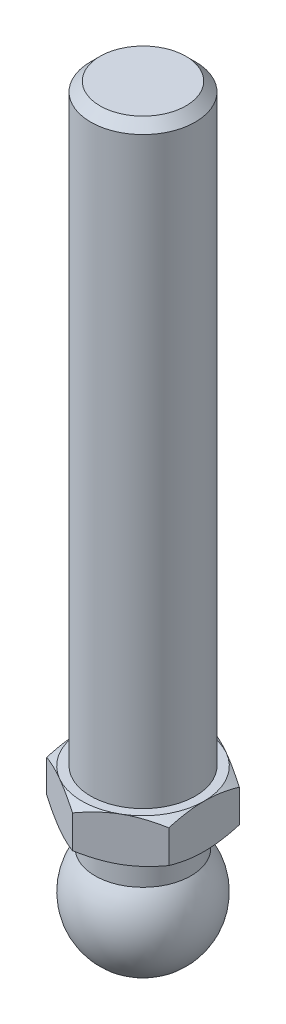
ISO-10303-21;
HEADER;
FILE_DESCRIPTION(('STEP AP214'),'2;1');
FILE_NAME('part.step','',(''),(''),'','','');
FILE_SCHEMA(('AUTOMOTIVE_DESIGN { 1 0 10303 214 1 1 1 1 }'));
ENDSEC;
DATA;
#1=APPLICATION_CONTEXT('core data for automotive mechanical design processes');
#2=APPLICATION_PROTOCOL_DEFINITION('international standard','automotive_design',2000,#1);
#3=PRODUCT_CONTEXT('',#1,'mechanical');
#4=PRODUCT('Part','Part','',(#3));
#5=PRODUCT_RELATED_PRODUCT_CATEGORY('part','',(#4));
#6=PRODUCT_DEFINITION_FORMATION('','',#4);
#7=PRODUCT_DEFINITION_CONTEXT('part definition',#1,'design');
#8=PRODUCT_DEFINITION('design','',#6,#7);
#9=PRODUCT_DEFINITION_SHAPE('','',#8);
#10=(LENGTH_UNIT() NAMED_UNIT(*) SI_UNIT(.MILLI.,.METRE.));
#11=(NAMED_UNIT(*) PLANE_ANGLE_UNIT() SI_UNIT($,.RADIAN.));
#12=(NAMED_UNIT(*) SI_UNIT($,.STERADIAN.) SOLID_ANGLE_UNIT());
#13=UNCERTAINTY_MEASURE_WITH_UNIT(LENGTH_MEASURE(1.E-05),#10,'distance_accuracy_value','');
#14=(GEOMETRIC_REPRESENTATION_CONTEXT(3) GLOBAL_UNCERTAINTY_ASSIGNED_CONTEXT((#13)) GLOBAL_UNIT_ASSIGNED_CONTEXT((#10,
#11,#12)) REPRESENTATION_CONTEXT('',''));
#15=CARTESIAN_POINT('',(0.,0.,0.));
#16=DIRECTION('',(0.,0.,1.));
#17=DIRECTION('',(1.,0.,0.));
#18=AXIS2_PLACEMENT_3D('',#15,#16,#17);
#19=CARTESIAN_POINT('',(0.,19.5,0.));
#20=DIRECTION('',(0.,-1.,0.));
#21=DIRECTION('',(0.,0.,-1.));
#22=AXIS2_PLACEMENT_3D('',#19,#20,#21);
#23=CONICAL_SURFACE('',#22,7.,1.0471975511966);
#24=CARTESIAN_POINT('',(-7.,15.2688336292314,12.5023453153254));
#25=CARTESIAN_POINT('',(-7.,15.4184696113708,12.2052647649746));
#26=CARTESIAN_POINT('',(-7.,15.5671267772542,11.9076861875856));
#27=CARTESIAN_POINT('',(-7.,15.8620076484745,11.3113035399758));
#28=CARTESIAN_POINT('',(-7.,16.0082312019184,11.0124993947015));
#29=CARTESIAN_POINT('',(-7.,16.2980281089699,10.4128982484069));
#30=CARTESIAN_POINT('',(-7.,16.441595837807,10.1120985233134));
#31=CARTESIAN_POINT('',(-7.,16.7251296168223,9.50881013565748));
#32=CARTESIAN_POINT('',(-7.,16.8650957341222,9.20632150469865));
#33=CARTESIAN_POINT('',(-7.,17.1470427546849,8.58510325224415));
#34=CARTESIAN_POINT('',(-7.,17.2888108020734,8.26627671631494));
#35=CARTESIAN_POINT('',(-7.,17.5662200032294,7.62594250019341));
#36=CARTESIAN_POINT('',(-7.,17.7018608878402,7.30443470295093));
#37=CARTESIAN_POINT('',(-7.,17.9652496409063,6.65840905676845));
#38=CARTESIAN_POINT('',(-7.,18.0930022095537,6.33389313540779));
#39=CARTESIAN_POINT('',(-7.,18.3384540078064,5.68109770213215));
#40=CARTESIAN_POINT('',(-7.,18.4561543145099,5.35281859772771));
#41=CARTESIAN_POINT('',(-7.,18.7028165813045,4.61998548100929));
#42=CARTESIAN_POINT('',(-7.,18.8286623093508,4.21436746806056));
#43=CARTESIAN_POINT('',(-7.,19.0543524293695,3.39574912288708));
#44=CARTESIAN_POINT('',(-7.,19.1541980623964,2.98274914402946));
#45=CARTESIAN_POINT('',(-7.,19.2776062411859,2.36178861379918));
#46=CARTESIAN_POINT('',(-7.,19.3141378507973,2.15638627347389));
#47=CARTESIAN_POINT('',(-7.,19.3780104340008,1.74416917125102));
#48=CARTESIAN_POINT('',(-7.,19.4053527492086,1.53735462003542));
#49=CARTESIAN_POINT('',(-7.,19.4500375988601,1.1227076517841));
#50=CARTESIAN_POINT('',(-7.,19.467383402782,0.914875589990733));
#51=CARTESIAN_POINT('',(-7.,19.4915250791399,0.498594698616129));
#52=CARTESIAN_POINT('',(-7.,19.4983210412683,0.290145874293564));
#53=CARTESIAN_POINT('',(-7.,19.5011397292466,-0.128421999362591));
#54=CARTESIAN_POINT('',(-7.,19.4970795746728,-0.338541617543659));
#55=CARTESIAN_POINT('',(-7.,19.4781521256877,-0.758289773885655));
#56=CARTESIAN_POINT('',(-7.,19.463284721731,-0.967918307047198));
#57=CARTESIAN_POINT('',(-7.,19.4232345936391,-1.38625975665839));
#58=CARTESIAN_POINT('',(-7.,19.3980479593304,-1.59497229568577));
#59=CARTESIAN_POINT('',(-7.,19.3381380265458,-2.01100790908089));
#60=CARTESIAN_POINT('',(-7.,19.3034145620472,-2.21833095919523));
#61=CARTESIAN_POINT('',(-7.,19.1849408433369,-2.84522045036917));
#62=CARTESIAN_POINT('',(-7.,19.0876569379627,-3.26225118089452));
#63=CARTESIAN_POINT('',(-7.,18.8658468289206,-4.08879182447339));
#64=CARTESIAN_POINT('',(-7.,18.7413180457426,-4.4983010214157));
#65=CARTESIAN_POINT('',(-7.,18.4953846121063,-5.2406101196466));
#66=CARTESIAN_POINT('',(-7.,18.3771372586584,-5.5744719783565));
#67=CARTESIAN_POINT('',(-7.,18.1300009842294,-6.23825206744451));
#68=CARTESIAN_POINT('',(-7.,18.0011107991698,-6.56816982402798));
#69=CARTESIAN_POINT('',(-7.,17.7350197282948,-7.22486424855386));
#70=CARTESIAN_POINT('',(-7.,17.5978135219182,-7.55163874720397));
#71=CARTESIAN_POINT('',(-7.,17.3169731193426,-8.20238370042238));
#72=CARTESIAN_POINT('',(-7.,17.1733392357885,-8.5263542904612));
#73=CARTESIAN_POINT('',(-7.,16.8876445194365,-9.15729037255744));
#74=CARTESIAN_POINT('',(-7.,16.7458097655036,-9.46435857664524));
#75=CARTESIAN_POINT('',(-7.,16.4583976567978,-10.0767426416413));
#76=CARTESIAN_POINT('',(-7.,16.3128202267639,-10.3820584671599));
#77=CARTESIAN_POINT('',(-7.,16.018926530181,-10.990585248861));
#78=CARTESIAN_POINT('',(-7.,15.8706165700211,-11.2937992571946));
#79=CARTESIAN_POINT('',(-7.,15.5714843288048,-11.8989613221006));
#80=CARTESIAN_POINT('',(-7.,15.4206622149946,-12.2009094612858));
#81=CARTESIAN_POINT('',(-7.,15.2688336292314,-12.5023453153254));
#82=B_SPLINE_CURVE_WITH_KNOTS('',3,(#24,#25,#26,#27,#28,#29,#30,#31,#32,#33,#34,#35,#36,#37,#38,
#39,#40,#41,#42,#43,#44,#45,#46,#47,#48,#49,#50,#51,#52,#53,#54,#55,#56,#57,#58,#59,#60,#61,#62,
#63,#64,#65,#66,#67,#68,#69,#70,#71,#72,#73,#74,#75,#76,#77,#78,#79,#80,#81),.UNSPECIFIED.,.F.,
.F.,(4,2,2,2,2,2,2,2,2,2,2,2,2,2,2,2,2,2,2,2,2,2,2,2,2,2,2,2,4),(0.,0.997917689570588,
1.99589743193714,2.99579247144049,3.99566886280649,5.04239250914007,6.08916209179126,
7.13530182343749,8.18132932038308,9.45480706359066,10.7282240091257,11.3539282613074,
11.9795411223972,12.6049492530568,13.2303520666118,13.8605430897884,14.490740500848,
15.1211769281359,15.7516243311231,17.0349275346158,18.3183522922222,19.380686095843,
20.4431462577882,21.506293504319,22.5693890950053,23.5840866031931,24.5988045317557,
25.6114179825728,26.6239642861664),.UNSPECIFIED.);
#83=CARTESIAN_POINT('',(-7.,18.8747852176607,4.04145188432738));
#84=VERTEX_POINT('',#83);
#85=CARTESIAN_POINT('',(-7.,19.5,0.));
#86=VERTEX_POINT('',#85);
#87=EDGE_CURVE('E358',#84,#86,#82,.T.);
#88=ORIENTED_EDGE('',*,*,#87,.F.);
#89=CARTESIAN_POINT('',(0.0002,18.8747185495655,8.0830192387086));
#90=CARTESIAN_POINT('',(-0.153667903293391,18.9260001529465,7.99418356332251));
#91=CARTESIAN_POINT('',(-0.30810950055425,18.9749544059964,7.90501666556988));
#92=CARTESIAN_POINT('',(-0.618246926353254,19.0675672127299,7.72595873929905));
#93=CARTESIAN_POINT('',(-0.773943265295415,19.1112234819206,7.63606741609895));
#94=CARTESIAN_POINT('',(-1.24352516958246,19.2333884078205,7.36495417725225));
#95=CARTESIAN_POINT('',(-1.5592643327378,19.302874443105,7.18266208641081));
#96=CARTESIAN_POINT('',(-2.03176224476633,19.3843550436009,6.9098652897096));
#97=CARTESIAN_POINT('',(-2.18710922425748,19.4075665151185,6.82017566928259));
#98=CARTESIAN_POINT('',(-2.49850511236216,19.4464887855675,6.64039116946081));
#99=CARTESIAN_POINT('',(-2.65455395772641,19.4622002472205,6.55029632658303));
#100=CARTESIAN_POINT('',(-2.96692267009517,19.4857220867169,6.36995016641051));
#101=CARTESIAN_POINT('',(-3.12324202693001,19.4935414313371,6.27969914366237));
#102=CARTESIAN_POINT('',(-3.43601650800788,19.5011197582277,6.09911871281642));
#103=CARTESIAN_POINT('',(-3.59247162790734,19.500878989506,6.00878930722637));
#104=CARTESIAN_POINT('',(-4.02110687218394,19.4891402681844,5.76131663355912));
#105=CARTESIAN_POINT('',(-4.2931466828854,19.4694342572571,5.60425437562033));
#106=CARTESIAN_POINT('',(-4.83541944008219,19.4069465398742,5.29117305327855));
#107=CARTESIAN_POINT('',(-5.10565047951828,19.364143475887,5.13515508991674));
#108=CARTESIAN_POINT('',(-5.64901454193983,19.2571483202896,4.82144370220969));
#109=CARTESIAN_POINT('',(-5.92207900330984,19.1925029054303,4.66378986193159));
#110=CARTESIAN_POINT('',(-6.46413578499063,19.045783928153,4.35083323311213));
#111=CARTESIAN_POINT('',(-6.73313504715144,18.9637448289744,4.19552643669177));
#112=CARTESIAN_POINT('',(-7.0002,18.8747185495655,4.04133641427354));
#113=B_SPLINE_CURVE_WITH_KNOTS('',3,(#89,#90,#91,#92,#93,#94,#95,#96,#97,#98,#99,#100,#101,#102,
#103,#104,#105,#106,#107,#108,#109,#110,#111,#112),.UNSPECIFIED.,.F.,.F.,(4,2,2,2,2,2,2,2,2,2,2,
4),(0.,0.554727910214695,1.10969417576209,2.2219327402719,2.76443041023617,3.30688013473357,
3.8487128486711,4.39052882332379,5.33376515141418,6.27787517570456,7.2429241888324,
8.20607866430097),.UNSPECIFIED.);
#114=CARTESIAN_POINT('',(-3.5,19.5,6.06217782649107));
#115=VERTEX_POINT('',#114);
#116=EDGE_CURVE('E147',#115,#84,#113,.T.);
#117=ORIENTED_EDGE('',*,*,#116,.F.);
#118=CARTESIAN_POINT('',(0.,19.5,0.));
#119=DIRECTION('',(0.,-1.,0.));
#120=DIRECTION('',(0.,0.,-1.));
#121=AXIS2_PLACEMENT_3D('',#118,#119,#120);
#122=CIRCLE('',#121,7.);
#123=EDGE_CURVE('E316',#115,#86,#122,.T.);
#124=ORIENTED_EDGE('',*,*,#123,.T.);
#125=EDGE_LOOP('',(#88,#117,#124));
#126=FACE_BOUND('',#125,.T.);
#127=ADVANCED_FACE('F17',(#126),#23,.T.);
#128=CARTESIAN_POINT('',(-7.,18.8747852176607,-4.04145188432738));
#129=VERTEX_POINT('',#128);
#130=EDGE_CURVE('E212',#86,#129,#82,.T.);
#131=ORIENTED_EDGE('',*,*,#130,.F.);
#132=CARTESIAN_POINT('',(-3.5,19.5,-6.06217782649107));
#133=VERTEX_POINT('',#132);
#134=EDGE_CURVE('E339',#86,#133,#122,.T.);
#135=ORIENTED_EDGE('',*,*,#134,.T.);
#136=CARTESIAN_POINT('',(-7.0002,18.8747185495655,-4.04133641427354));
#137=CARTESIAN_POINT('',(-6.84633209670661,18.9260001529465,-4.13017208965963));
#138=CARTESIAN_POINT('',(-6.69189049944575,18.9749544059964,-4.21933898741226));
#139=CARTESIAN_POINT('',(-6.38175307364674,19.0675672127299,-4.39839691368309));
#140=CARTESIAN_POINT('',(-6.22605673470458,19.1112234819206,-4.48828823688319));
#141=CARTESIAN_POINT('',(-5.75647483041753,19.2333884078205,-4.75940147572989));
#142=CARTESIAN_POINT('',(-5.4407356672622,19.302874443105,-4.94169356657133));
#143=CARTESIAN_POINT('',(-4.96823775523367,19.3843550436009,-5.21449036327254));
#144=CARTESIAN_POINT('',(-4.81289077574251,19.4075665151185,-5.30417998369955));
#145=CARTESIAN_POINT('',(-4.50149488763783,19.4464887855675,-5.48396448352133));
#146=CARTESIAN_POINT('',(-4.34544604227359,19.4622002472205,-5.57405932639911));
#147=CARTESIAN_POINT('',(-4.03307732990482,19.4857220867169,-5.75440548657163));
#148=CARTESIAN_POINT('',(-3.87675797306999,19.4935414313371,-5.84465650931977));
#149=CARTESIAN_POINT('',(-3.56398349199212,19.5011197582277,-6.02523694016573));
#150=CARTESIAN_POINT('',(-3.40752837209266,19.500878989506,-6.11556634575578));
#151=CARTESIAN_POINT('',(-2.97889312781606,19.4891402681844,-6.36303901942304));
#152=CARTESIAN_POINT('',(-2.7068533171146,19.4694342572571,-6.52010127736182));
#153=CARTESIAN_POINT('',(-2.1645805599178,19.4069465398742,-6.83318259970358));
#154=CARTESIAN_POINT('',(-1.89434952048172,19.364143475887,-6.9892005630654));
#155=CARTESIAN_POINT('',(-1.35098545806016,19.2571483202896,-7.30291195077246));
#156=CARTESIAN_POINT('',(-1.07792099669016,19.1925029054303,-7.46056579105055));
#157=CARTESIAN_POINT('',(-0.53586421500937,19.045783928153,-7.77352241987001));
#158=CARTESIAN_POINT('',(-0.26686495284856,18.9637448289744,-7.92882921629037));
#159=CARTESIAN_POINT('',(0.000200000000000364,18.8747185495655,-8.0830192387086));
#160=B_SPLINE_CURVE_WITH_KNOTS('',3,(#136,#137,#138,#139,#140,#141,#142,#143,#144,#145,#146,
#147,#148,#149,#150,#151,#152,#153,#154,#155,#156,#157,#158,#159),.UNSPECIFIED.,.F.,.F.,(4,2,2,
2,2,2,2,2,2,2,2,4),(0.,0.554727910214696,1.10969417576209,2.2219327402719,2.76443041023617,
3.30688013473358,3.8487128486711,4.39052882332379,5.33376515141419,6.27787517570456,
7.2429241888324,8.20607866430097),.UNSPECIFIED.);
#161=EDGE_CURVE('E204',#129,#133,#160,.T.);
#162=ORIENTED_EDGE('',*,*,#161,.F.);
#163=EDGE_LOOP('',(#131,#135,#162));
#164=FACE_BOUND('',#163,.T.);
#165=ADVANCED_FACE('F405',(#164),#23,.T.);
#166=CARTESIAN_POINT('',(0.,18.8747852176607,-8.08290376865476));
#167=VERTEX_POINT('',#166);
#168=EDGE_CURVE('E205',#133,#167,#160,.T.);
#169=ORIENTED_EDGE('',*,*,#168,.F.);
#170=CARTESIAN_POINT('',(3.5,19.5,-6.06217782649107));
#171=VERTEX_POINT('',#170);
#172=EDGE_CURVE('E330',#133,#171,#122,.T.);
#173=ORIENTED_EDGE('',*,*,#172,.T.);
#174=CARTESIAN_POINT('',(-0.0002,18.8747185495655,-8.0830192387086));
#175=CARTESIAN_POINT('',(0.153667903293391,18.9260001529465,-7.99418356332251));
#176=CARTESIAN_POINT('',(0.30810950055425,18.9749544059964,-7.90501666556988));
#177=CARTESIAN_POINT('',(0.618246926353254,19.0675672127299,-7.72595873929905));
#178=CARTESIAN_POINT('',(0.773943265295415,19.1112234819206,-7.63606741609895));
#179=CARTESIAN_POINT('',(1.24352516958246,19.2333884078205,-7.36495417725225));
#180=CARTESIAN_POINT('',(1.5592643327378,19.302874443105,-7.18266208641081));
#181=CARTESIAN_POINT('',(2.03176224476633,19.3843550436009,-6.9098652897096));
#182=CARTESIAN_POINT('',(2.18710922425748,19.4075665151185,-6.82017566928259));
#183=CARTESIAN_POINT('',(2.49850511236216,19.4464887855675,-6.64039116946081));
#184=CARTESIAN_POINT('',(2.65455395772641,19.4622002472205,-6.55029632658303));
#185=CARTESIAN_POINT('',(2.96692267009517,19.4857220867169,-6.36995016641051));
#186=CARTESIAN_POINT('',(3.12324202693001,19.4935414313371,-6.27969914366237));
#187=CARTESIAN_POINT('',(3.43601650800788,19.5011197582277,-6.09911871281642));
#188=CARTESIAN_POINT('',(3.59247162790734,19.500878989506,-6.00878930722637));
#189=CARTESIAN_POINT('',(4.02110687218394,19.4891402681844,-5.76131663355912));
#190=CARTESIAN_POINT('',(4.2931466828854,19.4694342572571,-5.60425437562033));
#191=CARTESIAN_POINT('',(4.83541944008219,19.4069465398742,-5.29117305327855));
#192=CARTESIAN_POINT('',(5.10565047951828,19.364143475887,-5.13515508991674));
#193=CARTESIAN_POINT('',(5.64901454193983,19.2571483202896,-4.82144370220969));
#194=CARTESIAN_POINT('',(5.92207900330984,19.1925029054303,-4.66378986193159));
#195=CARTESIAN_POINT('',(6.46413578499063,19.045783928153,-4.35083323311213));
#196=CARTESIAN_POINT('',(6.73313504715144,18.9637448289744,-4.19552643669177));
#197=CARTESIAN_POINT('',(7.0002,18.8747185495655,-4.04133641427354));
#198=B_SPLINE_CURVE_WITH_KNOTS('',3,(#174,#175,#176,#177,#178,#179,#180,#181,#182,#183,#184,
#185,#186,#187,#188,#189,#190,#191,#192,#193,#194,#195,#196,#197),.UNSPECIFIED.,.F.,.F.,(4,2,2,
2,2,2,2,2,2,2,2,4),(0.,0.554727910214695,1.10969417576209,2.2219327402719,2.76443041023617,
3.30688013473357,3.8487128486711,4.39052882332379,5.33376515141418,6.27787517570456,
7.2429241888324,8.20607866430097),.UNSPECIFIED.);
#199=EDGE_CURVE('E246',#167,#171,#198,.T.);
#200=ORIENTED_EDGE('',*,*,#199,.F.);
#201=EDGE_LOOP('',(#169,#173,#200));
#202=FACE_BOUND('',#201,.T.);
#203=ADVANCED_FACE('F411',(#202),#23,.T.);
#204=CARTESIAN_POINT('',(7.,18.8747852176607,-4.04145188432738));
#205=VERTEX_POINT('',#204);
#206=EDGE_CURVE('E247',#171,#205,#198,.T.);
#207=ORIENTED_EDGE('',*,*,#206,.F.);
#208=CARTESIAN_POINT('',(7.,19.5,0.));
#209=VERTEX_POINT('',#208);
#210=EDGE_CURVE('E323',#171,#209,#122,.T.);
#211=ORIENTED_EDGE('',*,*,#210,.T.);
#212=CARTESIAN_POINT('',(7.,15.2688336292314,-12.5023453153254));
#213=CARTESIAN_POINT('',(7.,15.4184696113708,-12.2052647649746));
#214=CARTESIAN_POINT('',(7.,15.5671267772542,-11.9076861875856));
#215=CARTESIAN_POINT('',(7.,15.8620076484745,-11.3113035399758));
#216=CARTESIAN_POINT('',(7.,16.0082312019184,-11.0124993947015));
#217=CARTESIAN_POINT('',(7.,16.2980281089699,-10.4128982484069));
#218=CARTESIAN_POINT('',(7.,16.441595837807,-10.1120985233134));
#219=CARTESIAN_POINT('',(7.,16.7251296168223,-9.50881013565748));
#220=CARTESIAN_POINT('',(7.,16.8650957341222,-9.20632150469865));
#221=CARTESIAN_POINT('',(7.,17.1470427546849,-8.58510325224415));
#222=CARTESIAN_POINT('',(7.,17.2888108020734,-8.26627671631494));
#223=CARTESIAN_POINT('',(7.,17.5662200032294,-7.62594250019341));
#224=CARTESIAN_POINT('',(7.,17.7018608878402,-7.30443470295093));
#225=CARTESIAN_POINT('',(7.,17.9652496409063,-6.65840905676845));
#226=CARTESIAN_POINT('',(7.,18.0930022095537,-6.33389313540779));
#227=CARTESIAN_POINT('',(7.,18.3384540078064,-5.68109770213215));
#228=CARTESIAN_POINT('',(7.,18.4561543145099,-5.35281859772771));
#229=CARTESIAN_POINT('',(7.,18.7028165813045,-4.61998548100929));
#230=CARTESIAN_POINT('',(7.,18.8286623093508,-4.21436746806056));
#231=CARTESIAN_POINT('',(7.,19.0543524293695,-3.39574912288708));
#232=CARTESIAN_POINT('',(7.,19.1541980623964,-2.98274914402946));
#233=CARTESIAN_POINT('',(7.,19.2776062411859,-2.36178861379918));
#234=CARTESIAN_POINT('',(7.,19.3141378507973,-2.15638627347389));
#235=CARTESIAN_POINT('',(7.,19.3780104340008,-1.74416917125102));
#236=CARTESIAN_POINT('',(7.,19.4053527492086,-1.53735462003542));
#237=CARTESIAN_POINT('',(7.,19.4500375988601,-1.1227076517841));
#238=CARTESIAN_POINT('',(7.,19.467383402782,-0.914875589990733));
#239=CARTESIAN_POINT('',(7.,19.4915250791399,-0.498594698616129));
#240=CARTESIAN_POINT('',(7.,19.4983210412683,-0.290145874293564));
#241=CARTESIAN_POINT('',(7.,19.5011397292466,0.128421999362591));
#242=CARTESIAN_POINT('',(7.,19.4970795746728,0.338541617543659));
#243=CARTESIAN_POINT('',(7.,19.4781521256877,0.758289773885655));
#244=CARTESIAN_POINT('',(7.,19.463284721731,0.967918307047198));
#245=CARTESIAN_POINT('',(7.,19.4232345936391,1.38625975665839));
#246=CARTESIAN_POINT('',(7.,19.3980479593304,1.59497229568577));
#247=CARTESIAN_POINT('',(7.,19.3381380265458,2.01100790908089));
#248=CARTESIAN_POINT('',(7.,19.3034145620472,2.21833095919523));
#249=CARTESIAN_POINT('',(7.,19.1849408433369,2.84522045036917));
#250=CARTESIAN_POINT('',(7.,19.0876569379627,3.26225118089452));
#251=CARTESIAN_POINT('',(7.,18.8658468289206,4.08879182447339));
#252=CARTESIAN_POINT('',(7.,18.7413180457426,4.4983010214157));
#253=CARTESIAN_POINT('',(7.,18.4953846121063,5.2406101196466));
#254=CARTESIAN_POINT('',(7.,18.3771372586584,5.5744719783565));
#255=CARTESIAN_POINT('',(7.,18.1300009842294,6.23825206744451));
#256=CARTESIAN_POINT('',(7.,18.0011107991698,6.56816982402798));
#257=CARTESIAN_POINT('',(7.,17.7350197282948,7.22486424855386));
#258=CARTESIAN_POINT('',(7.,17.5978135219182,7.55163874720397));
#259=CARTESIAN_POINT('',(7.,17.3169731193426,8.20238370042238));
#260=CARTESIAN_POINT('',(7.,17.1733392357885,8.5263542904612));
#261=CARTESIAN_POINT('',(7.,16.8876445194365,9.15729037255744));
#262=CARTESIAN_POINT('',(7.,16.7458097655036,9.46435857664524));
#263=CARTESIAN_POINT('',(7.,16.4583976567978,10.0767426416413));
#264=CARTESIAN_POINT('',(7.,16.3128202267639,10.3820584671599));
#265=CARTESIAN_POINT('',(7.,16.018926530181,10.990585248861));
#266=CARTESIAN_POINT('',(7.,15.8706165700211,11.2937992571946));
#267=CARTESIAN_POINT('',(7.,15.5714843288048,11.8989613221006));
#268=CARTESIAN_POINT('',(7.,15.4206622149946,12.2009094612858));
#269=CARTESIAN_POINT('',(7.,15.2688336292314,12.5023453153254));
#270=B_SPLINE_CURVE_WITH_KNOTS('',3,(#212,#213,#214,#215,#216,#217,#218,#219,#220,#221,#222,
#223,#224,#225,#226,#227,#228,#229,#230,#231,#232,#233,#234,#235,#236,#237,#238,#239,#240,#241,
#242,#243,#244,#245,#246,#247,#248,#249,#250,#251,#252,#253,#254,#255,#256,#257,#258,#259,#260,
#261,#262,#263,#264,#265,#266,#267,#268,#269),.UNSPECIFIED.,.F.,.F.,(4,2,2,2,2,2,2,2,2,2,2,2,2,
2,2,2,2,2,2,2,2,2,2,2,2,2,2,2,4),(0.,0.997917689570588,1.99589743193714,2.99579247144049,
3.99566886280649,5.04239250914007,6.08916209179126,7.13530182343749,8.18132932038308,
9.45480706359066,10.7282240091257,11.3539282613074,11.9795411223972,12.6049492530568,
13.2303520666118,13.8605430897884,14.490740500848,15.1211769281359,15.7516243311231,
17.0349275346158,18.3183522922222,19.380686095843,20.4431462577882,21.506293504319,
22.5693890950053,23.5840866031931,24.5988045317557,25.6114179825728,26.6239642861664),.UNSPECIFIED.);
#271=EDGE_CURVE('E269',#205,#209,#270,.T.);
#272=ORIENTED_EDGE('',*,*,#271,.F.);
#273=EDGE_LOOP('',(#207,#211,#272));
#274=FACE_BOUND('',#273,.T.);
#275=ADVANCED_FACE('F421',(#274),#23,.T.);
#276=CARTESIAN_POINT('',(7.,18.8747852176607,4.04145188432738));
#277=VERTEX_POINT('',#276);
#278=EDGE_CURVE('E270',#209,#277,#270,.T.);
#279=ORIENTED_EDGE('',*,*,#278,.F.);
#280=CARTESIAN_POINT('',(3.5,19.5,6.06217782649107));
#281=VERTEX_POINT('',#280);
#282=EDGE_CURVE('E313',#209,#281,#122,.T.);
#283=ORIENTED_EDGE('',*,*,#282,.T.);
#284=CARTESIAN_POINT('',(7.0002,18.8747185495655,4.04133641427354));
#285=CARTESIAN_POINT('',(6.84633209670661,18.9260001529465,4.13017208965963));
#286=CARTESIAN_POINT('',(6.69189049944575,18.9749544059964,4.21933898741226));
#287=CARTESIAN_POINT('',(6.38175307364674,19.0675672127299,4.39839691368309));
#288=CARTESIAN_POINT('',(6.22605673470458,19.1112234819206,4.48828823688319));
#289=CARTESIAN_POINT('',(5.75647483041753,19.2333884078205,4.75940147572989));
#290=CARTESIAN_POINT('',(5.4407356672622,19.302874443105,4.94169356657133));
#291=CARTESIAN_POINT('',(4.96823775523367,19.3843550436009,5.21449036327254));
#292=CARTESIAN_POINT('',(4.81289077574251,19.4075665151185,5.30417998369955));
#293=CARTESIAN_POINT('',(4.50149488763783,19.4464887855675,5.48396448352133));
#294=CARTESIAN_POINT('',(4.34544604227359,19.4622002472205,5.57405932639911));
#295=CARTESIAN_POINT('',(4.03307732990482,19.4857220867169,5.75440548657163));
#296=CARTESIAN_POINT('',(3.87675797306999,19.4935414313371,5.84465650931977));
#297=CARTESIAN_POINT('',(3.56398349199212,19.5011197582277,6.02523694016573));
#298=CARTESIAN_POINT('',(3.40752837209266,19.500878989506,6.11556634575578));
#299=CARTESIAN_POINT('',(2.97889312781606,19.4891402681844,6.36303901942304));
#300=CARTESIAN_POINT('',(2.7068533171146,19.4694342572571,6.52010127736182));
#301=CARTESIAN_POINT('',(2.1645805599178,19.4069465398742,6.83318259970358));
#302=CARTESIAN_POINT('',(1.89434952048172,19.364143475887,6.9892005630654));
#303=CARTESIAN_POINT('',(1.35098545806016,19.2571483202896,7.30291195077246));
#304=CARTESIAN_POINT('',(1.07792099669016,19.1925029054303,7.46056579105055));
#305=CARTESIAN_POINT('',(0.53586421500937,19.045783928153,7.77352241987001));
#306=CARTESIAN_POINT('',(0.26686495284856,18.9637448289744,7.92882921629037));
#307=CARTESIAN_POINT('',(-0.000200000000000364,18.8747185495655,8.0830192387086));
#308=B_SPLINE_CURVE_WITH_KNOTS('',3,(#284,#285,#286,#287,#288,#289,#290,#291,#292,#293,#294,
#295,#296,#297,#298,#299,#300,#301,#302,#303,#304,#305,#306,#307),.UNSPECIFIED.,.F.,.F.,(4,2,2,
2,2,2,2,2,2,2,2,4),(0.,0.554727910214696,1.10969417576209,2.2219327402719,2.76443041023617,
3.30688013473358,3.8487128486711,4.39052882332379,5.33376515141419,6.27787517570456,
7.2429241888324,8.20607866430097),.UNSPECIFIED.);
#309=EDGE_CURVE('E137',#277,#281,#308,.T.);
#310=ORIENTED_EDGE('',*,*,#309,.F.);
#311=EDGE_LOOP('',(#279,#283,#310));
#312=FACE_BOUND('',#311,.T.);
#313=ADVANCED_FACE('F319',(#312),#23,.T.);
#314=CARTESIAN_POINT('',(0.,18.8747852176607,8.08290376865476));
#315=VERTEX_POINT('',#314);
#316=EDGE_CURVE('E121',#281,#315,#308,.T.);
#317=ORIENTED_EDGE('',*,*,#316,.F.);
#318=EDGE_CURVE('E308',#281,#115,#122,.T.);
#319=ORIENTED_EDGE('',*,*,#318,.T.);
#320=EDGE_CURVE('E33',#315,#115,#113,.T.);
#321=ORIENTED_EDGE('',*,*,#320,.F.);
#322=EDGE_LOOP('',(#317,#319,#321));
#323=FACE_BOUND('',#322,.T.);
#324=ADVANCED_FACE('F307',(#323),#23,.T.);
#325=CARTESIAN_POINT('',(6.,19.5,0.));
#326=DIRECTION('',(0.,-1.,0.));
#327=DIRECTION('',(0.,0.,-1.));
#328=AXIS2_PLACEMENT_3D('',#325,#326,#327);
#329=PLANE('',#328);
#330=CARTESIAN_POINT('',(0.,19.5,0.));
#331=DIRECTION('',(0.,-1.,0.));
#332=DIRECTION('',(0.,0.,-1.));
#333=AXIS2_PLACEMENT_3D('',#330,#331,#332);
#334=CIRCLE('',#333,6.);
#335=CARTESIAN_POINT('',(0.,19.5,-6.));
#336=VERTEX_POINT('',#335);
#337=EDGE_CURVE('E322',#336,#336,#334,.F.);
#338=ORIENTED_EDGE('',*,*,#337,.F.);
#339=EDGE_LOOP('',(#338));
#340=FACE_BOUND('',#339,.T.);
#341=ORIENTED_EDGE('',*,*,#282,.F.);
#342=ORIENTED_EDGE('',*,*,#210,.F.);
#343=ORIENTED_EDGE('',*,*,#172,.F.);
#344=ORIENTED_EDGE('',*,*,#134,.F.);
#345=ORIENTED_EDGE('',*,*,#123,.F.);
#346=ORIENTED_EDGE('',*,*,#318,.F.);
#347=EDGE_LOOP('',(#341,#342,#343,#344,#345,#346));
#348=FACE_BOUND('',#347,.T.);
#349=ADVANCED_FACE('F226',(#340,#348),#329,.F.);
#350=CARTESIAN_POINT('',(-7.,14.3,-4.04145188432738));
#351=DIRECTION('',(-1.,0.,0.));
#352=DIRECTION('',(0.,0.,1.));
#353=AXIS2_PLACEMENT_3D('',#350,#351,#352);
#354=PLANE('',#353);
#355=ORIENTED_EDGE('',*,*,#87,.T.);
#356=ORIENTED_EDGE('',*,*,#130,.T.);
#357=DIRECTION('',(0.,1.,0.));
#358=VECTOR('',#357,1.);
#359=CARTESIAN_POINT('',(-7.,14.3,-4.04145188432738));
#360=LINE('',#359,#358);
#361=CARTESIAN_POINT('',(-7.,15.1252147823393,-4.04145188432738));
#362=VERTEX_POINT('',#361);
#363=EDGE_CURVE('E114',#362,#129,#360,.T.);
#364=ORIENTED_EDGE('',*,*,#363,.F.);
#365=CARTESIAN_POINT('',(-7.,18.7311663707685,-12.5023453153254));
#366=CARTESIAN_POINT('',(-7.,18.5815303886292,-12.2052647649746));
#367=CARTESIAN_POINT('',(-7.,18.4328732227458,-11.9076861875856));
#368=CARTESIAN_POINT('',(-7.,18.1379923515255,-11.3113035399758));
#369=CARTESIAN_POINT('',(-7.,17.9917687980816,-11.0124993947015));
#370=CARTESIAN_POINT('',(-7.,17.7019718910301,-10.4128982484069));
#371=CARTESIAN_POINT('',(-7.,17.558404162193,-10.1120985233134));
#372=CARTESIAN_POINT('',(-7.,17.2748703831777,-9.50881013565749));
#373=CARTESIAN_POINT('',(-7.,17.1349042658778,-9.20632150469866));
#374=CARTESIAN_POINT('',(-7.,16.8529572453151,-8.58510325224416));
#375=CARTESIAN_POINT('',(-7.,16.7111891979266,-8.26627671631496));
#376=CARTESIAN_POINT('',(-7.,16.4337799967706,-7.62594250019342));
#377=CARTESIAN_POINT('',(-7.,16.2981391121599,-7.30443470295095));
#378=CARTESIAN_POINT('',(-7.,16.0347503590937,-6.65840905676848));
#379=CARTESIAN_POINT('',(-7.,15.9069977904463,-6.33389313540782));
#380=CARTESIAN_POINT('',(-7.,15.6615459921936,-5.68109770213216));
#381=CARTESIAN_POINT('',(-7.,15.5438456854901,-5.35281859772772));
#382=CARTESIAN_POINT('',(-7.,15.2971834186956,-4.6199854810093));
#383=CARTESIAN_POINT('',(-7.,15.1713376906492,-4.21436746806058));
#384=CARTESIAN_POINT('',(-7.,14.9456475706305,-3.39574912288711));
#385=CARTESIAN_POINT('',(-7.,14.8458019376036,-2.98274914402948));
#386=CARTESIAN_POINT('',(-7.,14.7223937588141,-2.3617886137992));
#387=CARTESIAN_POINT('',(-7.,14.6858621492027,-2.1563862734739));
#388=CARTESIAN_POINT('',(-7.,14.6219895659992,-1.74416917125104));
#389=CARTESIAN_POINT('',(-7.,14.5946472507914,-1.53735462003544));
#390=CARTESIAN_POINT('',(-7.,14.5499624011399,-1.12270765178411));
#391=CARTESIAN_POINT('',(-7.,14.532616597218,-0.914875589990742));
#392=CARTESIAN_POINT('',(-7.,14.5084749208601,-0.498594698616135));
#393=CARTESIAN_POINT('',(-7.,14.5016789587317,-0.290145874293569));
#394=CARTESIAN_POINT('',(-7.,14.4988602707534,0.128421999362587));
#395=CARTESIAN_POINT('',(-7.,14.5029204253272,0.338541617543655));
#396=CARTESIAN_POINT('',(-7.,14.5218478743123,0.758289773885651));
#397=CARTESIAN_POINT('',(-7.,14.5367152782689,0.967918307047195));
#398=CARTESIAN_POINT('',(-7.,14.5767654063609,1.38625975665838));
#399=CARTESIAN_POINT('',(-7.,14.6019520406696,1.59497229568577));
#400=CARTESIAN_POINT('',(-7.,14.6618619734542,2.01100790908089));
#401=CARTESIAN_POINT('',(-7.,14.6965854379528,2.21833095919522));
#402=CARTESIAN_POINT('',(-7.,14.8150591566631,2.84522045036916));
#403=CARTESIAN_POINT('',(-7.,14.9123430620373,3.26225118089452));
#404=CARTESIAN_POINT('',(-7.,15.1341531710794,4.08879182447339));
#405=CARTESIAN_POINT('',(-7.,15.2586819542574,4.4983010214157));
#406=CARTESIAN_POINT('',(-7.,15.5046153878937,5.2406101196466));
#407=CARTESIAN_POINT('',(-7.,15.6228627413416,5.5744719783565));
#408=CARTESIAN_POINT('',(-7.,15.8699990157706,6.23825206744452));
#409=CARTESIAN_POINT('',(-7.,15.9988892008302,6.56816982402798));
#410=CARTESIAN_POINT('',(-7.,16.2649802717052,7.22486424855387));
#411=CARTESIAN_POINT('',(-7.,16.4021864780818,7.55163874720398));
#412=CARTESIAN_POINT('',(-7.,16.6830268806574,8.20238370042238));
#413=CARTESIAN_POINT('',(-7.,16.8266607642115,8.5263542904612));
#414=CARTESIAN_POINT('',(-7.,17.1123554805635,9.15729037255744));
#415=CARTESIAN_POINT('',(-7.,17.2541902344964,9.46435857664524));
#416=CARTESIAN_POINT('',(-7.,17.5416023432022,10.0767426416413));
#417=CARTESIAN_POINT('',(-7.,17.6871797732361,10.38205846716));
#418=CARTESIAN_POINT('',(-7.,17.981073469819,10.990585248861));
#419=CARTESIAN_POINT('',(-7.,18.1293834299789,11.2937992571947));
#420=CARTESIAN_POINT('',(-7.,18.4285156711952,11.8989613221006));
#421=CARTESIAN_POINT('',(-7.,18.5793377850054,12.2009094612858));
#422=CARTESIAN_POINT('',(-7.,18.7311663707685,12.5023453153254));
#423=B_SPLINE_CURVE_WITH_KNOTS('',3,(#365,#366,#367,#368,#369,#370,#371,#372,#373,#374,#375,
#376,#377,#378,#379,#380,#381,#382,#383,#384,#385,#386,#387,#388,#389,#390,#391,#392,#393,#394,
#395,#396,#397,#398,#399,#400,#401,#402,#403,#404,#405,#406,#407,#408,#409,#410,#411,#412,#413,
#414,#415,#416,#417,#418,#419,#420,#421,#422),.UNSPECIFIED.,.F.,.F.,(4,2,2,2,2,2,2,2,2,2,2,2,2,
2,2,2,2,2,2,2,2,2,2,2,2,2,2,2,4),(0.,0.997917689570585,1.99589743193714,2.99579247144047,
3.99566886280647,5.04239250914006,6.08916209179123,7.13530182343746,8.18132932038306,
9.45480706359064,10.7282240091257,11.3539282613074,11.9795411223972,12.6049492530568,
13.2303520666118,13.8605430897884,14.490740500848,15.1211769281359,15.7516243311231,
17.0349275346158,18.3183522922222,19.380686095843,20.4431462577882,21.506293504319,
22.5693890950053,23.5840866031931,24.5988045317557,25.6114179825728,26.6239642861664),.UNSPECIFIED.);
#424=CARTESIAN_POINT('',(-7.,14.5,0.));
#425=VERTEX_POINT('',#424);
#426=EDGE_CURVE('E203',#362,#425,#423,.T.);
#427=ORIENTED_EDGE('',*,*,#426,.T.);
#428=CARTESIAN_POINT('',(-7.,15.1252147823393,4.04145188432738));
#429=VERTEX_POINT('',#428);
#430=EDGE_CURVE('E193',#425,#429,#423,.T.);
#431=ORIENTED_EDGE('',*,*,#430,.T.);
#432=DIRECTION('',(0.,1.,0.));
#433=VECTOR('',#432,1.);
#434=CARTESIAN_POINT('',(-7.,14.3,4.04145188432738));
#435=LINE('',#434,#433);
#436=EDGE_CURVE('E124',#429,#84,#435,.T.);
#437=ORIENTED_EDGE('',*,*,#436,.T.);
#438=EDGE_LOOP('',(#355,#356,#364,#427,#431,#437));
#439=FACE_BOUND('',#438,.T.);
#440=ADVANCED_FACE('F221',(#439),#354,.T.);
#441=CARTESIAN_POINT('',(0.,14.3,-8.08290376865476));
#442=DIRECTION('',(-0.5,0.,-0.866025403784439));
#443=DIRECTION('',(-0.866025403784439,0.,0.5));
#444=AXIS2_PLACEMENT_3D('',#441,#442,#443);
#445=PLANE('',#444);
#446=ORIENTED_EDGE('',*,*,#161,.T.);
#447=ORIENTED_EDGE('',*,*,#168,.T.);
#448=DIRECTION('',(0.,1.,0.));
#449=VECTOR('',#448,1.);
#450=CARTESIAN_POINT('',(0.,14.3,-8.08290376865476));
#451=LINE('',#450,#449);
#452=CARTESIAN_POINT('',(0.,15.1252147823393,-8.08290376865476));
#453=VERTEX_POINT('',#452);
#454=EDGE_CURVE('E445',#453,#167,#451,.T.);
#455=ORIENTED_EDGE('',*,*,#454,.F.);
#456=CARTESIAN_POINT('',(0.000200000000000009,15.1252814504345,-8.0830192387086));
#457=CARTESIAN_POINT('',(-0.153667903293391,15.0739998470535,-7.99418356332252));
#458=CARTESIAN_POINT('',(-0.30810950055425,15.0250455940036,-7.90501666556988));
#459=CARTESIAN_POINT('',(-0.618246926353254,14.9324327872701,-7.72595873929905));
#460=CARTESIAN_POINT('',(-0.773943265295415,14.8887765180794,-7.63606741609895));
#461=CARTESIAN_POINT('',(-1.24352516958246,14.7666115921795,-7.36495417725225));
#462=CARTESIAN_POINT('',(-1.5592643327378,14.697125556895,-7.18266208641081));
#463=CARTESIAN_POINT('',(-2.03176224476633,14.6156449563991,-6.9098652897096));
#464=CARTESIAN_POINT('',(-2.18710922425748,14.5924334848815,-6.82017566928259));
#465=CARTESIAN_POINT('',(-2.49850511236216,14.5535112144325,-6.64039116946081));
#466=CARTESIAN_POINT('',(-2.65455395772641,14.5377997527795,-6.55029632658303));
#467=CARTESIAN_POINT('',(-2.96692267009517,14.5142779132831,-6.36995016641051));
#468=CARTESIAN_POINT('',(-3.12324202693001,14.5064585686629,-6.27969914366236));
#469=CARTESIAN_POINT('',(-3.43601650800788,14.4988802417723,-6.09911871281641));
#470=CARTESIAN_POINT('',(-3.59247162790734,14.499121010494,-6.00878930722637));
#471=CARTESIAN_POINT('',(-4.02110687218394,14.5108597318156,-5.76131663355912));
#472=CARTESIAN_POINT('',(-4.2931466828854,14.5305657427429,-5.60425437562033));
#473=CARTESIAN_POINT('',(-4.8354194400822,14.5930534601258,-5.29117305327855));
#474=CARTESIAN_POINT('',(-5.10565047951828,14.635856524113,-5.13515508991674));
#475=CARTESIAN_POINT('',(-5.64901454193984,14.7428516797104,-4.82144370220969));
#476=CARTESIAN_POINT('',(-5.92207900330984,14.8074970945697,-4.66378986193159));
#477=CARTESIAN_POINT('',(-6.46413578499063,14.954216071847,-4.35083323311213));
#478=CARTESIAN_POINT('',(-6.73313504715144,15.0362551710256,-4.19552643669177));
#479=CARTESIAN_POINT('',(-7.0002,15.1252814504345,-4.04133641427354));
#480=B_SPLINE_CURVE_WITH_KNOTS('',3,(#456,#457,#458,#459,#460,#461,#462,#463,#464,#465,#466,
#467,#468,#469,#470,#471,#472,#473,#474,#475,#476,#477,#478,#479),.UNSPECIFIED.,.F.,.F.,(4,2,2,
2,2,2,2,2,2,2,2,4),(0.,0.554727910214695,1.10969417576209,2.2219327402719,2.76443041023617,
3.30688013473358,3.8487128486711,4.39052882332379,5.33376515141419,6.27787517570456,
7.2429241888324,8.20607866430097),.UNSPECIFIED.);
#481=CARTESIAN_POINT('',(-3.5,14.5,-6.06217782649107));
#482=VERTEX_POINT('',#481);
#483=EDGE_CURVE('E245',#453,#482,#480,.T.);
#484=ORIENTED_EDGE('',*,*,#483,.T.);
#485=EDGE_CURVE('E237',#482,#362,#480,.T.);
#486=ORIENTED_EDGE('',*,*,#485,.T.);
#487=ORIENTED_EDGE('',*,*,#363,.T.);
#488=EDGE_LOOP('',(#446,#447,#455,#484,#486,#487));
#489=FACE_BOUND('',#488,.T.);
#490=ADVANCED_FACE('F225',(#489),#445,.T.);
#491=CARTESIAN_POINT('',(7.,14.3,-4.04145188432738));
#492=DIRECTION('',(0.5,0.,-0.866025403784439));
#493=DIRECTION('',(-0.866025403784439,0.,-0.5));
#494=AXIS2_PLACEMENT_3D('',#491,#492,#493);
#495=PLANE('',#494);
#496=ORIENTED_EDGE('',*,*,#199,.T.);
#497=ORIENTED_EDGE('',*,*,#206,.T.);
#498=DIRECTION('',(0.,1.,0.));
#499=VECTOR('',#498,1.);
#500=CARTESIAN_POINT('',(7.,14.3,-4.04145188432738));
#501=LINE('',#500,#499);
#502=CARTESIAN_POINT('',(7.,15.1252147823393,-4.04145188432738));
#503=VERTEX_POINT('',#502);
#504=EDGE_CURVE('E462',#503,#205,#501,.T.);
#505=ORIENTED_EDGE('',*,*,#504,.F.);
#506=CARTESIAN_POINT('',(7.0002,15.1252814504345,-4.04133641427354));
#507=CARTESIAN_POINT('',(6.84633209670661,15.0739998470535,-4.13017208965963));
#508=CARTESIAN_POINT('',(6.69189049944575,15.0250455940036,-4.21933898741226));
#509=CARTESIAN_POINT('',(6.38175307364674,14.9324327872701,-4.39839691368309));
#510=CARTESIAN_POINT('',(6.22605673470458,14.8887765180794,-4.48828823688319));
#511=CARTESIAN_POINT('',(5.75647483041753,14.7666115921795,-4.75940147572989));
#512=CARTESIAN_POINT('',(5.4407356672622,14.697125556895,-4.94169356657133));
#513=CARTESIAN_POINT('',(4.96823775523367,14.6156449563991,-5.21449036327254));
#514=CARTESIAN_POINT('',(4.81289077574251,14.5924334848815,-5.30417998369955));
#515=CARTESIAN_POINT('',(4.50149488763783,14.5535112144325,-5.48396448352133));
#516=CARTESIAN_POINT('',(4.34544604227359,14.5377997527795,-5.57405932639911));
#517=CARTESIAN_POINT('',(4.03307732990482,14.5142779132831,-5.75440548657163));
#518=CARTESIAN_POINT('',(3.87675797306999,14.5064585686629,-5.84465650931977));
#519=CARTESIAN_POINT('',(3.56398349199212,14.4988802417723,-6.02523694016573));
#520=CARTESIAN_POINT('',(3.40752837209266,14.499121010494,-6.11556634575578));
#521=CARTESIAN_POINT('',(2.97889312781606,14.5108597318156,-6.36303901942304));
#522=CARTESIAN_POINT('',(2.7068533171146,14.5305657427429,-6.52010127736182));
#523=CARTESIAN_POINT('',(2.1645805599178,14.5930534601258,-6.83318259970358));
#524=CARTESIAN_POINT('',(1.89434952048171,14.635856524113,-6.9892005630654));
#525=CARTESIAN_POINT('',(1.35098545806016,14.7428516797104,-7.30291195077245));
#526=CARTESIAN_POINT('',(1.07792099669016,14.8074970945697,-7.46056579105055));
#527=CARTESIAN_POINT('',(0.53586421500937,14.954216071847,-7.77352241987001));
#528=CARTESIAN_POINT('',(0.266864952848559,15.0362551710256,-7.92882921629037));
#529=CARTESIAN_POINT('',(-0.000199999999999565,15.1252814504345,-8.0830192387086));
#530=B_SPLINE_CURVE_WITH_KNOTS('',3,(#506,#507,#508,#509,#510,#511,#512,#513,#514,#515,#516,
#517,#518,#519,#520,#521,#522,#523,#524,#525,#526,#527,#528,#529),.UNSPECIFIED.,.F.,.F.,(4,2,2,
2,2,2,2,2,2,2,2,4),(0.,0.554727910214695,1.10969417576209,2.2219327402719,2.76443041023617,
3.30688013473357,3.8487128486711,4.39052882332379,5.33376515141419,6.27787517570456,
7.2429241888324,8.20607866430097),.UNSPECIFIED.);
#531=CARTESIAN_POINT('',(3.5,14.5,-6.06217782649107));
#532=VERTEX_POINT('',#531);
#533=EDGE_CURVE('E268',#503,#532,#530,.T.);
#534=ORIENTED_EDGE('',*,*,#533,.T.);
#535=EDGE_CURVE('E260',#532,#453,#530,.T.);
#536=ORIENTED_EDGE('',*,*,#535,.T.);
#537=ORIENTED_EDGE('',*,*,#454,.T.);
#538=EDGE_LOOP('',(#496,#497,#505,#534,#536,#537));
#539=FACE_BOUND('',#538,.T.);
#540=ADVANCED_FACE('F233',(#539),#495,.T.);
#541=CARTESIAN_POINT('',(7.,14.3,4.04145188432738));
#542=DIRECTION('',(1.,0.,0.));
#543=DIRECTION('',(0.,0.,-1.));
#544=AXIS2_PLACEMENT_3D('',#541,#542,#543);
#545=PLANE('',#544);
#546=ORIENTED_EDGE('',*,*,#271,.T.);
#547=ORIENTED_EDGE('',*,*,#278,.T.);
#548=DIRECTION('',(0.,1.,0.));
#549=VECTOR('',#548,1.);
#550=CARTESIAN_POINT('',(7.,14.3,4.04145188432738));
#551=LINE('',#550,#549);
#552=CARTESIAN_POINT('',(7.,15.1252147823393,4.04145188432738));
#553=VERTEX_POINT('',#552);
#554=EDGE_CURVE('E123',#553,#277,#551,.T.);
#555=ORIENTED_EDGE('',*,*,#554,.F.);
#556=CARTESIAN_POINT('',(7.,18.7311663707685,12.5023453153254));
#557=CARTESIAN_POINT('',(7.,18.5815303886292,12.2052647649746));
#558=CARTESIAN_POINT('',(7.,18.4328732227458,11.9076861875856));
#559=CARTESIAN_POINT('',(7.,18.1379923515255,11.3113035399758));
#560=CARTESIAN_POINT('',(7.,17.9917687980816,11.0124993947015));
#561=CARTESIAN_POINT('',(7.,17.7019718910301,10.4128982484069));
#562=CARTESIAN_POINT('',(7.,17.558404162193,10.1120985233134));
#563=CARTESIAN_POINT('',(7.,17.2748703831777,9.50881013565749));
#564=CARTESIAN_POINT('',(7.,17.1349042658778,9.20632150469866));
#565=CARTESIAN_POINT('',(7.,16.8529572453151,8.58510325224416));
#566=CARTESIAN_POINT('',(7.,16.7111891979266,8.26627671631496));
#567=CARTESIAN_POINT('',(7.,16.4337799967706,7.62594250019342));
#568=CARTESIAN_POINT('',(7.,16.2981391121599,7.30443470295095));
#569=CARTESIAN_POINT('',(7.,16.0347503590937,6.65840905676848));
#570=CARTESIAN_POINT('',(7.,15.9069977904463,6.33389313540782));
#571=CARTESIAN_POINT('',(7.,15.6615459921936,5.68109770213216));
#572=CARTESIAN_POINT('',(7.,15.5438456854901,5.35281859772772));
#573=CARTESIAN_POINT('',(7.,15.2971834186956,4.6199854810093));
#574=CARTESIAN_POINT('',(7.,15.1713376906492,4.21436746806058));
#575=CARTESIAN_POINT('',(7.,14.9456475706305,3.39574912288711));
#576=CARTESIAN_POINT('',(7.,14.8458019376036,2.98274914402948));
#577=CARTESIAN_POINT('',(7.,14.7223937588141,2.3617886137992));
#578=CARTESIAN_POINT('',(7.,14.6858621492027,2.1563862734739));
#579=CARTESIAN_POINT('',(7.,14.6219895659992,1.74416917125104));
#580=CARTESIAN_POINT('',(7.,14.5946472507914,1.53735462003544));
#581=CARTESIAN_POINT('',(7.,14.5499624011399,1.12270765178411));
#582=CARTESIAN_POINT('',(7.,14.532616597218,0.914875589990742));
#583=CARTESIAN_POINT('',(7.,14.5084749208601,0.498594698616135));
#584=CARTESIAN_POINT('',(7.,14.5016789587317,0.290145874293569));
#585=CARTESIAN_POINT('',(7.,14.4988602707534,-0.128421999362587));
#586=CARTESIAN_POINT('',(7.,14.5029204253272,-0.338541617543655));
#587=CARTESIAN_POINT('',(7.,14.5218478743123,-0.758289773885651));
#588=CARTESIAN_POINT('',(7.,14.5367152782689,-0.967918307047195));
#589=CARTESIAN_POINT('',(7.,14.5767654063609,-1.38625975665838));
#590=CARTESIAN_POINT('',(7.,14.6019520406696,-1.59497229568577));
#591=CARTESIAN_POINT('',(7.,14.6618619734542,-2.01100790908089));
#592=CARTESIAN_POINT('',(7.,14.6965854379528,-2.21833095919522));
#593=CARTESIAN_POINT('',(7.,14.8150591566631,-2.84522045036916));
#594=CARTESIAN_POINT('',(7.,14.9123430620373,-3.26225118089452));
#595=CARTESIAN_POINT('',(7.,15.1341531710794,-4.08879182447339));
#596=CARTESIAN_POINT('',(7.,15.2586819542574,-4.4983010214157));
#597=CARTESIAN_POINT('',(7.,15.5046153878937,-5.2406101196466));
#598=CARTESIAN_POINT('',(7.,15.6228627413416,-5.5744719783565));
#599=CARTESIAN_POINT('',(7.,15.8699990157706,-6.23825206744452));
#600=CARTESIAN_POINT('',(7.,15.9988892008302,-6.56816982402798));
#601=CARTESIAN_POINT('',(7.,16.2649802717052,-7.22486424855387));
#602=CARTESIAN_POINT('',(7.,16.4021864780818,-7.55163874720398));
#603=CARTESIAN_POINT('',(7.,16.6830268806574,-8.20238370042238));
#604=CARTESIAN_POINT('',(7.,16.8266607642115,-8.5263542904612));
#605=CARTESIAN_POINT('',(7.,17.1123554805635,-9.15729037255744));
#606=CARTESIAN_POINT('',(7.,17.2541902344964,-9.46435857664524));
#607=CARTESIAN_POINT('',(7.,17.5416023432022,-10.0767426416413));
#608=CARTESIAN_POINT('',(7.,17.6871797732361,-10.38205846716));
#609=CARTESIAN_POINT('',(7.,17.981073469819,-10.990585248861));
#610=CARTESIAN_POINT('',(7.,18.1293834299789,-11.2937992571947));
#611=CARTESIAN_POINT('',(7.,18.4285156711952,-11.8989613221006));
#612=CARTESIAN_POINT('',(7.,18.5793377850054,-12.2009094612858));
#613=CARTESIAN_POINT('',(7.,18.7311663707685,-12.5023453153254));
#614=B_SPLINE_CURVE_WITH_KNOTS('',3,(#556,#557,#558,#559,#560,#561,#562,#563,#564,#565,#566,
#567,#568,#569,#570,#571,#572,#573,#574,#575,#576,#577,#578,#579,#580,#581,#582,#583,#584,#585,
#586,#587,#588,#589,#590,#591,#592,#593,#594,#595,#596,#597,#598,#599,#600,#601,#602,#603,#604,
#605,#606,#607,#608,#609,#610,#611,#612,#613),.UNSPECIFIED.,.F.,.F.,(4,2,2,2,2,2,2,2,2,2,2,2,2,
2,2,2,2,2,2,2,2,2,2,2,2,2,2,2,4),(0.,0.997917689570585,1.99589743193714,2.99579247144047,
3.99566886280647,5.04239250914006,6.08916209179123,7.13530182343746,8.18132932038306,
9.45480706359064,10.7282240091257,11.3539282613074,11.9795411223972,12.6049492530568,
13.2303520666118,13.8605430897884,14.490740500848,15.1211769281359,15.7516243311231,
17.0349275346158,18.3183522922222,19.380686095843,20.4431462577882,21.506293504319,
22.5693890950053,23.5840866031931,24.5988045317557,25.6114179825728,26.6239642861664),.UNSPECIFIED.);
#615=CARTESIAN_POINT('',(7.,14.5,0.));
#616=VERTEX_POINT('',#615);
#617=EDGE_CURVE('E288',#553,#616,#614,.T.);
#618=ORIENTED_EDGE('',*,*,#617,.T.);
#619=EDGE_CURVE('E281',#616,#503,#614,.T.);
#620=ORIENTED_EDGE('',*,*,#619,.T.);
#621=ORIENTED_EDGE('',*,*,#504,.T.);
#622=EDGE_LOOP('',(#546,#547,#555,#618,#620,#621));
#623=FACE_BOUND('',#622,.T.);
#624=ADVANCED_FACE('F169',(#623),#545,.T.);
#625=CARTESIAN_POINT('',(0.,14.3,8.08290376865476));
#626=DIRECTION('',(0.5,0.,0.866025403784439));
#627=DIRECTION('',(0.866025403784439,0.,-0.5));
#628=AXIS2_PLACEMENT_3D('',#625,#626,#627);
#629=PLANE('',#628);
#630=ORIENTED_EDGE('',*,*,#309,.T.);
#631=ORIENTED_EDGE('',*,*,#316,.T.);
#632=DIRECTION('',(0.,1.,0.));
#633=VECTOR('',#632,1.);
#634=CARTESIAN_POINT('',(0.,14.3,8.08290376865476));
#635=LINE('',#634,#633);
#636=CARTESIAN_POINT('',(0.,15.1252147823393,8.08290376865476));
#637=VERTEX_POINT('',#636);
#638=EDGE_CURVE('E108',#637,#315,#635,.T.);
#639=ORIENTED_EDGE('',*,*,#638,.F.);
#640=CARTESIAN_POINT('',(-0.000200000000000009,15.1252814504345,8.0830192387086));
#641=CARTESIAN_POINT('',(0.153667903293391,15.0739998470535,7.99418356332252));
#642=CARTESIAN_POINT('',(0.30810950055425,15.0250455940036,7.90501666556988));
#643=CARTESIAN_POINT('',(0.618246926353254,14.9324327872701,7.72595873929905));
#644=CARTESIAN_POINT('',(0.773943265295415,14.8887765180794,7.63606741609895));
#645=CARTESIAN_POINT('',(1.24352516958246,14.7666115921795,7.36495417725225));
#646=CARTESIAN_POINT('',(1.5592643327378,14.697125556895,7.18266208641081));
#647=CARTESIAN_POINT('',(2.03176224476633,14.6156449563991,6.9098652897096));
#648=CARTESIAN_POINT('',(2.18710922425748,14.5924334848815,6.82017566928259));
#649=CARTESIAN_POINT('',(2.49850511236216,14.5535112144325,6.64039116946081));
#650=CARTESIAN_POINT('',(2.65455395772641,14.5377997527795,6.55029632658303));
#651=CARTESIAN_POINT('',(2.96692267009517,14.5142779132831,6.36995016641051));
#652=CARTESIAN_POINT('',(3.12324202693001,14.5064585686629,6.27969914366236));
#653=CARTESIAN_POINT('',(3.43601650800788,14.4988802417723,6.09911871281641));
#654=CARTESIAN_POINT('',(3.59247162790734,14.499121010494,6.00878930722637));
#655=CARTESIAN_POINT('',(4.02110687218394,14.5108597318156,5.76131663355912));
#656=CARTESIAN_POINT('',(4.2931466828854,14.5305657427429,5.60425437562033));
#657=CARTESIAN_POINT('',(4.8354194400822,14.5930534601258,5.29117305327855));
#658=CARTESIAN_POINT('',(5.10565047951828,14.635856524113,5.13515508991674));
#659=CARTESIAN_POINT('',(5.64901454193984,14.7428516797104,4.82144370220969));
#660=CARTESIAN_POINT('',(5.92207900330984,14.8074970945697,4.66378986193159));
#661=CARTESIAN_POINT('',(6.46413578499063,14.954216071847,4.35083323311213));
#662=CARTESIAN_POINT('',(6.73313504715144,15.0362551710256,4.19552643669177));
#663=CARTESIAN_POINT('',(7.0002,15.1252814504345,4.04133641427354));
#664=B_SPLINE_CURVE_WITH_KNOTS('',3,(#640,#641,#642,#643,#644,#645,#646,#647,#648,#649,#650,
#651,#652,#653,#654,#655,#656,#657,#658,#659,#660,#661,#662,#663),.UNSPECIFIED.,.F.,.F.,(4,2,2,
2,2,2,2,2,2,2,2,4),(0.,0.554727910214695,1.10969417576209,2.2219327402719,2.76443041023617,
3.30688013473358,3.8487128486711,4.39052882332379,5.33376515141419,6.27787517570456,
7.2429241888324,8.20607866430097),.UNSPECIFIED.);
#665=CARTESIAN_POINT('',(3.5,14.5,6.06217782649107));
#666=VERTEX_POINT('',#665);
#667=EDGE_CURVE('E118',#637,#666,#664,.T.);
#668=ORIENTED_EDGE('',*,*,#667,.T.);
#669=EDGE_CURVE('E131',#666,#553,#664,.T.);
#670=ORIENTED_EDGE('',*,*,#669,.T.);
#671=ORIENTED_EDGE('',*,*,#554,.T.);
#672=EDGE_LOOP('',(#630,#631,#639,#668,#670,#671));
#673=FACE_BOUND('',#672,.T.);
#674=ADVANCED_FACE('F117',(#673),#629,.T.);
#675=CARTESIAN_POINT('',(-7.,14.3,4.04145188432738));
#676=DIRECTION('',(-0.5,0.,0.866025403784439));
#677=DIRECTION('',(0.866025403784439,0.,0.5));
#678=AXIS2_PLACEMENT_3D('',#675,#676,#677);
#679=PLANE('',#678);
#680=ORIENTED_EDGE('',*,*,#320,.T.);
#681=ORIENTED_EDGE('',*,*,#116,.T.);
#682=ORIENTED_EDGE('',*,*,#436,.F.);
#683=CARTESIAN_POINT('',(-7.0002,15.1252814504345,4.04133641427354));
#684=CARTESIAN_POINT('',(-6.84633209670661,15.0739998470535,4.13017208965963));
#685=CARTESIAN_POINT('',(-6.69189049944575,15.0250455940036,4.21933898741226));
#686=CARTESIAN_POINT('',(-6.38175307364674,14.9324327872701,4.39839691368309));
#687=CARTESIAN_POINT('',(-6.22605673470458,14.8887765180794,4.48828823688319));
#688=CARTESIAN_POINT('',(-5.75647483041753,14.7666115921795,4.75940147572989));
#689=CARTESIAN_POINT('',(-5.4407356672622,14.697125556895,4.94169356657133));
#690=CARTESIAN_POINT('',(-4.96823775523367,14.6156449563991,5.21449036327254));
#691=CARTESIAN_POINT('',(-4.81289077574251,14.5924334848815,5.30417998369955));
#692=CARTESIAN_POINT('',(-4.50149488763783,14.5535112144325,5.48396448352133));
#693=CARTESIAN_POINT('',(-4.34544604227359,14.5377997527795,5.57405932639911));
#694=CARTESIAN_POINT('',(-4.03307732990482,14.5142779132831,5.75440548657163));
#695=CARTESIAN_POINT('',(-3.87675797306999,14.5064585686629,5.84465650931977));
#696=CARTESIAN_POINT('',(-3.56398349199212,14.4988802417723,6.02523694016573));
#697=CARTESIAN_POINT('',(-3.40752837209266,14.499121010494,6.11556634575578));
#698=CARTESIAN_POINT('',(-2.97889312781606,14.5108597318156,6.36303901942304));
#699=CARTESIAN_POINT('',(-2.7068533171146,14.5305657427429,6.52010127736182));
#700=CARTESIAN_POINT('',(-2.1645805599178,14.5930534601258,6.83318259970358));
#701=CARTESIAN_POINT('',(-1.89434952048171,14.635856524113,6.9892005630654));
#702=CARTESIAN_POINT('',(-1.35098545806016,14.7428516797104,7.30291195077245));
#703=CARTESIAN_POINT('',(-1.07792099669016,14.8074970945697,7.46056579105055));
#704=CARTESIAN_POINT('',(-0.53586421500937,14.954216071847,7.77352241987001));
#705=CARTESIAN_POINT('',(-0.266864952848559,15.0362551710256,7.92882921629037));
#706=CARTESIAN_POINT('',(0.000199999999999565,15.1252814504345,8.0830192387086));
#707=B_SPLINE_CURVE_WITH_KNOTS('',3,(#683,#684,#685,#686,#687,#688,#689,#690,#691,#692,#693,
#694,#695,#696,#697,#698,#699,#700,#701,#702,#703,#704,#705,#706),.UNSPECIFIED.,.F.,.F.,(4,2,2,
2,2,2,2,2,2,2,2,4),(0.,0.554727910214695,1.10969417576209,2.2219327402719,2.76443041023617,
3.30688013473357,3.8487128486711,4.39052882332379,5.33376515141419,6.27787517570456,
7.2429241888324,8.20607866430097),.UNSPECIFIED.);
#708=CARTESIAN_POINT('',(-3.5,14.5,6.06217782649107));
#709=VERTEX_POINT('',#708);
#710=EDGE_CURVE('E40',#429,#709,#707,.T.);
#711=ORIENTED_EDGE('',*,*,#710,.T.);
#712=EDGE_CURVE('E105',#709,#637,#707,.T.);
#713=ORIENTED_EDGE('',*,*,#712,.T.);
#714=ORIENTED_EDGE('',*,*,#638,.T.);
#715=EDGE_LOOP('',(#680,#681,#682,#711,#713,#714));
#716=FACE_BOUND('',#715,.T.);
#717=ADVANCED_FACE('F107',(#716),#679,.T.);
#718=CARTESIAN_POINT('',(0.,0.,0.));
#719=DIRECTION('',(0.,-1.,0.));
#720=DIRECTION('',(0.,0.,-1.));
#721=AXIS2_PLACEMENT_3D('',#718,#719,#720);
#722=CYLINDRICAL_SURFACE('',#721,5.5);
#723=CARTESIAN_POINT('',(0.,11.3301270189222,0.));
#724=DIRECTION('',(0.,-1.,0.));
#725=DIRECTION('',(0.,0.,-1.));
#726=AXIS2_PLACEMENT_3D('',#723,#724,#725);
#727=CIRCLE('',#726,5.5);
#728=CARTESIAN_POINT('',(0.,11.3301270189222,-5.5));
#729=VERTEX_POINT('',#728);
#730=EDGE_CURVE('E473',#729,#729,#727,.T.);
#731=ORIENTED_EDGE('',*,*,#730,.F.);
#732=EDGE_LOOP('',(#731));
#733=FACE_BOUND('',#732,.T.);
#734=CARTESIAN_POINT('',(0.,14.5,0.));
#735=DIRECTION('',(0.,-1.,0.));
#736=DIRECTION('',(0.,0.,-1.));
#737=AXIS2_PLACEMENT_3D('',#734,#735,#736);
#738=CIRCLE('',#737,5.5);
#739=CARTESIAN_POINT('',(0.,14.5,-5.5));
#740=VERTEX_POINT('',#739);
#741=EDGE_CURVE('E350',#740,#740,#738,.T.);
#742=ORIENTED_EDGE('',*,*,#741,.T.);
#743=EDGE_LOOP('',(#742));
#744=FACE_BOUND('',#743,.T.);
#745=ADVANCED_FACE('F176',(#733,#744),#722,.T.);
#746=CARTESIAN_POINT('',(0.,17.,0.));
#747=DIRECTION('',(0.,1.,0.));
#748=DIRECTION('',(0.,0.,1.));
#749=AXIS2_PLACEMENT_3D('',#746,#747,#748);
#750=CONICAL_SURFACE('',#749,11.3301270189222,1.0471975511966);
#751=ORIENTED_EDGE('',*,*,#533,.F.);
#752=ORIENTED_EDGE('',*,*,#619,.F.);
#753=CARTESIAN_POINT('',(0.,14.5,0.));
#754=DIRECTION('',(0.,-1.,0.));
#755=DIRECTION('',(0.,0.,-1.));
#756=AXIS2_PLACEMENT_3D('',#753,#754,#755);
#757=CIRCLE('',#756,7.);
#758=EDGE_CURVE('E340',#532,#616,#757,.T.);
#759=ORIENTED_EDGE('',*,*,#758,.F.);
#760=EDGE_LOOP('',(#751,#752,#759));
#761=FACE_BOUND('',#760,.T.);
#762=ADVANCED_FACE('F163',(#761),#750,.T.);
#763=ORIENTED_EDGE('',*,*,#535,.F.);
#764=EDGE_CURVE('E349',#482,#532,#757,.T.);
#765=ORIENTED_EDGE('',*,*,#764,.F.);
#766=ORIENTED_EDGE('',*,*,#483,.F.);
#767=EDGE_LOOP('',(#763,#765,#766));
#768=FACE_BOUND('',#767,.T.);
#769=ADVANCED_FACE('F448',(#768),#750,.T.);
#770=ORIENTED_EDGE('',*,*,#485,.F.);
#771=EDGE_CURVE('E356',#425,#482,#757,.T.);
#772=ORIENTED_EDGE('',*,*,#771,.F.);
#773=ORIENTED_EDGE('',*,*,#426,.F.);
#774=EDGE_LOOP('',(#770,#772,#773));
#775=FACE_BOUND('',#774,.T.);
#776=ADVANCED_FACE('F383',(#775),#750,.T.);
#777=ORIENTED_EDGE('',*,*,#430,.F.);
#778=EDGE_CURVE('E346',#709,#425,#757,.T.);
#779=ORIENTED_EDGE('',*,*,#778,.F.);
#780=ORIENTED_EDGE('',*,*,#710,.F.);
#781=EDGE_LOOP('',(#777,#779,#780));
#782=FACE_BOUND('',#781,.T.);
#783=ADVANCED_FACE('F380',(#782),#750,.T.);
#784=ORIENTED_EDGE('',*,*,#617,.F.);
#785=ORIENTED_EDGE('',*,*,#669,.F.);
#786=EDGE_CURVE('E331',#616,#666,#757,.T.);
#787=ORIENTED_EDGE('',*,*,#786,.F.);
#788=EDGE_LOOP('',(#784,#785,#787));
#789=FACE_BOUND('',#788,.T.);
#790=ADVANCED_FACE('F395',(#789),#750,.T.);
#791=CARTESIAN_POINT('',(7.,14.5,0.));
#792=DIRECTION('',(0.,1.,0.));
#793=DIRECTION('',(0.,0.,1.));
#794=AXIS2_PLACEMENT_3D('',#791,#792,#793);
#795=PLANE('',#794);
#796=ORIENTED_EDGE('',*,*,#741,.F.);
#797=EDGE_LOOP('',(#796));
#798=FACE_BOUND('',#797,.T.);
#799=ORIENTED_EDGE('',*,*,#758,.T.);
#800=ORIENTED_EDGE('',*,*,#786,.T.);
#801=EDGE_CURVE('E128',#666,#709,#757,.T.);
#802=ORIENTED_EDGE('',*,*,#801,.T.);
#803=ORIENTED_EDGE('',*,*,#778,.T.);
#804=ORIENTED_EDGE('',*,*,#771,.T.);
#805=ORIENTED_EDGE('',*,*,#764,.T.);
#806=EDGE_LOOP('',(#799,#800,#802,#803,#804,#805));
#807=FACE_BOUND('',#806,.T.);
#808=ADVANCED_FACE('F386',(#798,#807),#795,.F.);
#809=ORIENTED_EDGE('',*,*,#667,.F.);
#810=ORIENTED_EDGE('',*,*,#712,.F.);
#811=ORIENTED_EDGE('',*,*,#801,.F.);
#812=EDGE_LOOP('',(#809,#810,#811));
#813=FACE_BOUND('',#812,.T.);
#814=ADVANCED_FACE('F126',(#813),#750,.T.);
#815=CARTESIAN_POINT('',(0.,7.,0.));
#816=DIRECTION('',(0.,-1.,0.));
#817=DIRECTION('',(-1.,0.,0.));
#818=AXIS2_PLACEMENT_3D('',#815,#816,#817);
#819=SPHERICAL_SURFACE('',#818,7.);
#820=ORIENTED_EDGE('',*,*,#730,.T.);
#821=EDGE_LOOP('',(#820));
#822=FACE_BOUND('',#821,.T.);
#823=ADVANCED_FACE('F228',(#822),#819,.T.);
#824=CARTESIAN_POINT('',(0.,87.5,0.));
#825=DIRECTION('',(0.,-1.,0.));
#826=DIRECTION('',(0.,0.,-1.));
#827=AXIS2_PLACEMENT_3D('',#824,#825,#826);
#828=CYLINDRICAL_SURFACE('',#827,6.);
#829=CARTESIAN_POINT('',(0.,86.4265,0.));
#830=DIRECTION('',(0.,1.,0.));
#831=DIRECTION('',(0.,0.,1.));
#832=AXIS2_PLACEMENT_3D('',#829,#830,#831);
#833=CIRCLE('',#832,6.);
#834=CARTESIAN_POINT('',(0.,86.4265,6.));
#835=VERTEX_POINT('',#834);
#836=EDGE_CURVE('E10',#835,#835,#833,.F.);
#837=ORIENTED_EDGE('',*,*,#836,.T.);
#838=EDGE_LOOP('',(#837));
#839=FACE_BOUND('',#838,.T.);
#840=ORIENTED_EDGE('',*,*,#337,.T.);
#841=EDGE_LOOP('',(#840));
#842=FACE_BOUND('',#841,.T.);
#843=ADVANCED_FACE('F640',(#839,#842),#828,.T.);
#844=CARTESIAN_POINT('',(0.,87.5,0.));
#845=DIRECTION('',(0.,1.,0.));
#846=DIRECTION('',(0.,0.,1.));
#847=AXIS2_PLACEMENT_3D('',#844,#845,#846);
#848=PLANE('',#847);
#849=CARTESIAN_POINT('',(0.,87.5,0.));
#850=DIRECTION('',(0.,1.,0.));
#851=DIRECTION('',(0.,0.,1.));
#852=AXIS2_PLACEMENT_3D('',#849,#850,#851);
#853=CIRCLE('',#852,4.9265);
#854=CARTESIAN_POINT('',(0.,87.5,4.9265));
#855=VERTEX_POINT('',#854);
#856=EDGE_CURVE('E26',#855,#855,#853,.T.);
#857=ORIENTED_EDGE('',*,*,#856,.T.);
#858=EDGE_LOOP('',(#857));
#859=FACE_BOUND('',#858,.T.);
#860=ADVANCED_FACE('F648',(#859),#848,.T.);
#861=CARTESIAN_POINT('',(0.,87.5,0.));
#862=DIRECTION('',(0.,-1.,0.));
#863=DIRECTION('',(0.,0.,-1.));
#864=AXIS2_PLACEMENT_3D('',#861,#862,#863);
#865=CONICAL_SURFACE('',#864,4.9265,0.785398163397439);
#866=ORIENTED_EDGE('',*,*,#836,.F.);
#867=EDGE_LOOP('',(#866));
#868=FACE_BOUND('',#867,.T.);
#869=ORIENTED_EDGE('',*,*,#856,.F.);
#870=EDGE_LOOP('',(#869));
#871=FACE_BOUND('',#870,.T.);
#872=ADVANCED_FACE('F20',(#868,#871),#865,.T.);
#873=CLOSED_SHELL('',(#127,#165,#203,#275,#313,#324,#349,#440,#490,#540,#624,#674,#717,#745,
#762,#769,#776,#783,#790,#808,#814,#823,#843,#860,#872));
#874=MANIFOLD_SOLID_BREP('B1',#873);
#875=ADVANCED_BREP_SHAPE_REPRESENTATION('',(#18,#874),#14);
#876=SHAPE_DEFINITION_REPRESENTATION(#9,#875);
ENDSEC;
END-ISO-10303-21;
